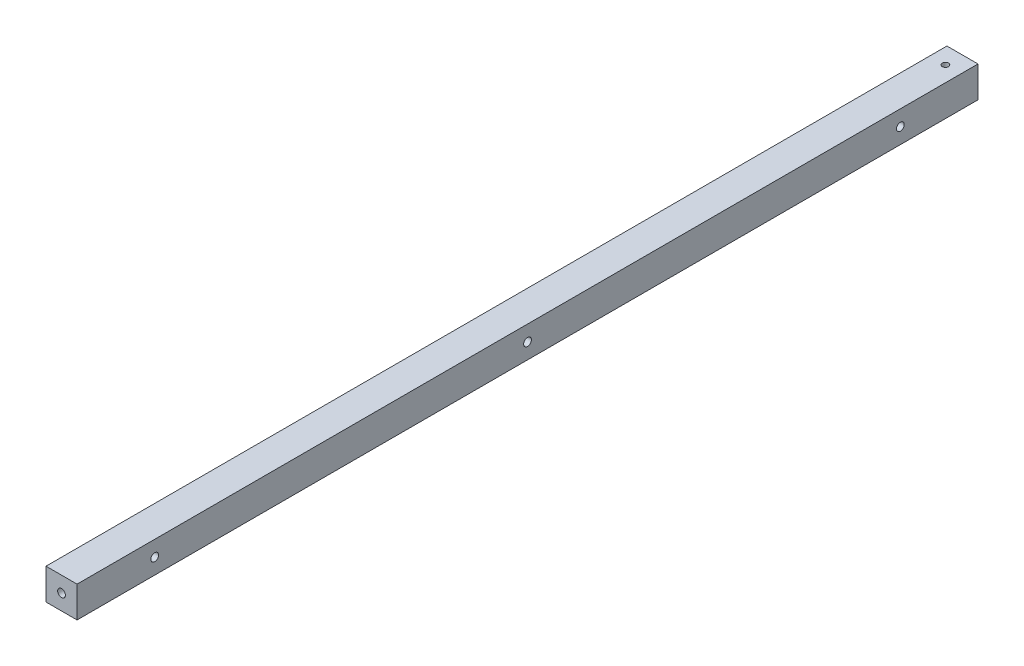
from build123d import *

# Parameters (mm, degrees)
ESQUISSE1_W                                 = 20
ESQUISSE1_H                                 = 20
EXTRUSION1_DEPTH                            = 580
DIAM_TRE_DU_PER_AGE_M12_5_12_500000_1_D     = 12.5
DIAM_TRE_DU_PER_AGE_M12_5_12_500000_1_DEPTH = 20
DIAM_TRE_DU_PER_AGE_M12_5_12_500000_1_TIP   = 3.755378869
DIAM_TRE_DU_PER_AGE_M4_0_4_000000_1_D       = 4
TROU_TARAUD_M6X1_01_D                       = 5
TROU_TARAUD_M6X1_02_D                       = 5
TROU_TARAUD_M6X1_02_DEPTH                   = 15
TROU_TARAUD_M6X1_02_TIP                     = 1.502151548


with BuildPart() as part:
    # Esquisse1 → Extrusion1 (new body)
    with BuildSketch(Plane.XY):
        Rectangle(ESQUISSE1_W, ESQUISSE1_H)
    extrude(amount=EXTRUSION1_DEPTH)

    # Diam_tre du per_age M12.5 _12.500000_1
    with Locations(Plane(origin=(0, 0, 0), x_dir=(-1, 0, 0), z_dir=(0, 0, -1))):
        with Locations((0, 0)):
            Hole(DIAM_TRE_DU_PER_AGE_M12_5_12_500000_1_D / 2, depth=DIAM_TRE_DU_PER_AGE_M12_5_12_500000_1_DEPTH)
            with Locations((0, 0, -(DIAM_TRE_DU_PER_AGE_M12_5_12_500000_1_DEPTH + DIAM_TRE_DU_PER_AGE_M12_5_12_500000_1_TIP / 2))):  # 118° drill point
                Cone(0, DIAM_TRE_DU_PER_AGE_M12_5_12_500000_1_D / 2, DIAM_TRE_DU_PER_AGE_M12_5_12_500000_1_TIP, mode=Mode.SUBTRACT)

    # Diam_tre du per_age M4.0 _4.000000_1 (through all)
    with Locations(Plane.XZ.offset(10)):
        with Locations((0, 11)):
            Hole(DIAM_TRE_DU_PER_AGE_M4_0_4_000000_1_D / 2)

    # Trou taraud_ M6x1.01 (through all)
    with Locations(Plane(origin=(10, 0, 0), x_dir=(0, 0, -1), z_dir=(1, 0, 0))):
        with Locations((-50, 0), (-290, 0), (-530, 0)):
            Hole(TROU_TARAUD_M6X1_01_D / 2)

    # Trou taraud_ M6x1.02
    with Locations(Plane.XY.offset(580)):
        with Locations((0, 0)):
            Hole(TROU_TARAUD_M6X1_02_D / 2, depth=TROU_TARAUD_M6X1_02_DEPTH)
            with Locations((0, 0, -(TROU_TARAUD_M6X1_02_DEPTH + TROU_TARAUD_M6X1_02_TIP / 2))):  # 118° drill point
                Cone(0, TROU_TARAUD_M6X1_02_D / 2, TROU_TARAUD_M6X1_02_TIP, mode=Mode.SUBTRACT)


solid = part.part
